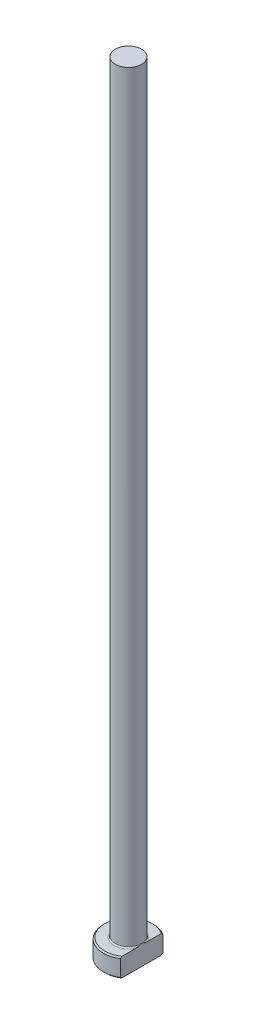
ISO-10303-21;
HEADER;
FILE_DESCRIPTION(('STEP AP214'),'2;1');
FILE_NAME('part.step','',(''),(''),'','','');
FILE_SCHEMA(('AUTOMOTIVE_DESIGN { 1 0 10303 214 1 1 1 1 }'));
ENDSEC;
DATA;
#1=APPLICATION_CONTEXT('core data for automotive mechanical design processes');
#2=APPLICATION_PROTOCOL_DEFINITION('international standard','automotive_design',2000,#1);
#3=PRODUCT_CONTEXT('',#1,'mechanical');
#4=PRODUCT('Part','Part','',(#3));
#5=PRODUCT_RELATED_PRODUCT_CATEGORY('part','',(#4));
#6=PRODUCT_DEFINITION_FORMATION('','',#4);
#7=PRODUCT_DEFINITION_CONTEXT('part definition',#1,'design');
#8=PRODUCT_DEFINITION('design','',#6,#7);
#9=PRODUCT_DEFINITION_SHAPE('','',#8);
#10=(LENGTH_UNIT() NAMED_UNIT(*) SI_UNIT(.MILLI.,.METRE.));
#11=(NAMED_UNIT(*) PLANE_ANGLE_UNIT() SI_UNIT($,.RADIAN.));
#12=(NAMED_UNIT(*) SI_UNIT($,.STERADIAN.) SOLID_ANGLE_UNIT());
#13=UNCERTAINTY_MEASURE_WITH_UNIT(LENGTH_MEASURE(1.E-05),#10,'distance_accuracy_value','');
#14=(GEOMETRIC_REPRESENTATION_CONTEXT(3) GLOBAL_UNCERTAINTY_ASSIGNED_CONTEXT((#13)) GLOBAL_UNIT_ASSIGNED_CONTEXT((#10,
#11,#12)) REPRESENTATION_CONTEXT('',''));
#15=CARTESIAN_POINT('',(0.,0.,0.));
#16=DIRECTION('',(0.,0.,1.));
#17=DIRECTION('',(1.,0.,0.));
#18=AXIS2_PLACEMENT_3D('',#15,#16,#17);
#19=CARTESIAN_POINT('',(0.,0.,0.));
#20=DIRECTION('',(0.,-1.,0.));
#21=DIRECTION('',(0.,0.,-1.));
#22=AXIS2_PLACEMENT_3D('',#19,#20,#21);
#23=PLANE('',#22);
#24=CARTESIAN_POINT('',(0.,0.,0.));
#25=DIRECTION('',(0.,-1.,0.));
#26=DIRECTION('',(0.,0.,-1.));
#27=AXIS2_PLACEMENT_3D('',#24,#25,#26);
#28=CIRCLE('',#27,3.79999999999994);
#29=CARTESIAN_POINT('',(2.09999999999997,0.,3.16701752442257));
#30=VERTEX_POINT('',#29);
#31=CARTESIAN_POINT('',(2.09999999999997,0.,-3.16701752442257));
#32=VERTEX_POINT('',#31);
#33=EDGE_CURVE('E98',#30,#32,#28,.T.);
#34=ORIENTED_EDGE('',*,*,#33,.T.);
#35=DIRECTION('',(0.,0.,1.));
#36=VECTOR('',#35,1.);
#37=CARTESIAN_POINT('',(2.09999999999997,0.,-3.40440890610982));
#38=LINE('',#37,#36);
#39=EDGE_CURVE('E83',#32,#30,#38,.T.);
#40=ORIENTED_EDGE('',*,*,#39,.T.);
#41=EDGE_LOOP('',(#34,#40));
#42=FACE_BOUND('',#41,.T.);
#43=ADVANCED_FACE('F32',(#42),#23,.T.);
#44=CARTESIAN_POINT('',(0.,259.958771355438,0.));
#45=DIRECTION('',(0.,1.,0.));
#46=DIRECTION('',(0.,0.,1.));
#47=AXIS2_PLACEMENT_3D('',#44,#45,#46);
#48=CYLINDRICAL_SURFACE('',#47,3.99999999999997);
#49=CARTESIAN_POINT('',(0.,2.79999999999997,0.));
#50=DIRECTION('',(0.,1.,0.));
#51=DIRECTION('',(0.,0.,1.));
#52=AXIS2_PLACEMENT_3D('',#49,#50,#51);
#53=CIRCLE('',#52,3.99999999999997);
#54=CARTESIAN_POINT('',(2.09999999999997,2.79999999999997,3.40440890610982));
#55=VERTEX_POINT('',#54);
#56=CARTESIAN_POINT('',(2.09999999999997,2.79999999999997,-3.40440890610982));
#57=VERTEX_POINT('',#56);
#58=EDGE_CURVE('E104',#55,#57,#53,.F.);
#59=ORIENTED_EDGE('',*,*,#58,.T.);
#60=DIRECTION('',(0.,-1.,0.));
#61=VECTOR('',#60,1.);
#62=CARTESIAN_POINT('',(2.09999999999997,125.,-3.40440890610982));
#63=LINE('',#62,#61);
#64=CARTESIAN_POINT('',(2.09999999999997,0.200000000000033,-3.40440890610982));
#65=VERTEX_POINT('',#64);
#66=EDGE_CURVE('E183',#57,#65,#63,.T.);
#67=ORIENTED_EDGE('',*,*,#66,.T.);
#68=CARTESIAN_POINT('',(0.,0.200000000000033,0.));
#69=DIRECTION('',(0.,-1.,0.));
#70=DIRECTION('',(0.,0.,-1.));
#71=AXIS2_PLACEMENT_3D('',#68,#69,#70);
#72=CIRCLE('',#71,3.99999999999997);
#73=CARTESIAN_POINT('',(2.09999999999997,0.200000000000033,3.40440890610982));
#74=VERTEX_POINT('',#73);
#75=EDGE_CURVE('E100',#65,#74,#72,.F.);
#76=ORIENTED_EDGE('',*,*,#75,.T.);
#77=DIRECTION('',(0.,-1.,0.));
#78=VECTOR('',#77,1.);
#79=CARTESIAN_POINT('',(2.09999999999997,125.,3.40440890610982));
#80=LINE('',#79,#78);
#81=EDGE_CURVE('E93',#55,#74,#80,.T.);
#82=ORIENTED_EDGE('',*,*,#81,.F.);
#83=EDGE_LOOP('',(#59,#67,#76,#82));
#84=FACE_BOUND('',#83,.T.);
#85=ADVANCED_FACE('F158',(#84),#48,.T.);
#86=CARTESIAN_POINT('',(-3.99999999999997,3.,0.));
#87=DIRECTION('',(0.,1.,0.));
#88=DIRECTION('',(0.,0.,1.));
#89=AXIS2_PLACEMENT_3D('',#86,#87,#88);
#90=PLANE('',#89);
#91=CARTESIAN_POINT('',(0.,3.,0.));
#92=DIRECTION('',(0.,1.,0.));
#93=DIRECTION('',(0.,0.,1.));
#94=AXIS2_PLACEMENT_3D('',#91,#92,#93);
#95=CIRCLE('',#94,3.79999999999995);
#96=CARTESIAN_POINT('',(2.09999999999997,3.,-3.16701752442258));
#97=VERTEX_POINT('',#96);
#98=CARTESIAN_POINT('',(2.09999999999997,3.,3.16701752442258));
#99=VERTEX_POINT('',#98);
#100=EDGE_CURVE('E178',#97,#99,#95,.T.);
#101=ORIENTED_EDGE('',*,*,#100,.T.);
#102=DIRECTION('',(0.,0.,-1.));
#103=VECTOR('',#102,1.);
#104=CARTESIAN_POINT('',(2.09999999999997,3.,0.));
#105=LINE('',#104,#103);
#106=CARTESIAN_POINT('',(2.09999999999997,2.99999999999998,0.938083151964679));
#107=VERTEX_POINT('',#106);
#108=EDGE_CURVE('E57',#99,#107,#105,.T.);
#109=ORIENTED_EDGE('',*,*,#108,.T.);
#110=CARTESIAN_POINT('',(0.,3.,0.));
#111=DIRECTION('',(0.,1.,0.));
#112=DIRECTION('',(0.,0.,1.));
#113=AXIS2_PLACEMENT_3D('',#110,#111,#112);
#114=CIRCLE('',#113,2.29999999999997);
#115=CARTESIAN_POINT('',(2.09999999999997,2.99999999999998,-0.938083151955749));
#116=VERTEX_POINT('',#115);
#117=EDGE_CURVE('E107',#107,#116,#114,.F.);
#118=ORIENTED_EDGE('',*,*,#117,.T.);
#119=EDGE_CURVE('E136',#116,#97,#105,.T.);
#120=ORIENTED_EDGE('',*,*,#119,.T.);
#121=EDGE_LOOP('',(#101,#109,#118,#120));
#122=FACE_BOUND('',#121,.T.);
#123=ADVANCED_FACE('F147',(#122),#90,.T.);
#124=CARTESIAN_POINT('',(0.,3.,0.));
#125=DIRECTION('',(0.,-1.,0.));
#126=DIRECTION('',(0.,0.,-1.));
#127=AXIS2_PLACEMENT_3D('',#124,#125,#126);
#128=CONICAL_SURFACE('',#127,3.79999999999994,0.785398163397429);
#129=ORIENTED_EDGE('',*,*,#58,.F.);
#130=CARTESIAN_POINT('',(2.09999999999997,-0.980423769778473,7.49166163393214));
#131=CARTESIAN_POINT('',(2.09999999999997,-0.831474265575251,7.33696373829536));
#132=CARTESIAN_POINT('',(2.09999999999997,-0.682692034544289,7.1821043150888));
#133=CARTESIAN_POINT('',(2.09999999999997,-0.385548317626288,6.87197961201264));
#134=CARTESIAN_POINT('',(2.09999999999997,-0.237186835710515,6.71671432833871));
#135=CARTESIAN_POINT('',(2.09999999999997,0.0590779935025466,6.40564381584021));
#136=CARTESIAN_POINT('',(2.09999999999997,0.206981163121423,6.24983841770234));
#137=CARTESIAN_POINT('',(2.09999999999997,0.502154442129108,5.9376299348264));
#138=CARTESIAN_POINT('',(2.09999999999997,0.649424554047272,5.78122685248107));
#139=CARTESIAN_POINT('',(2.09999999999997,0.940776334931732,5.47022973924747));
#140=CARTESIAN_POINT('',(2.09999999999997,1.08487085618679,5.31564775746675));
#141=CARTESIAN_POINT('',(2.09999999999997,1.372076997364,5.0055736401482));
#142=CARTESIAN_POINT('',(2.09999999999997,1.51518862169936,4.85008150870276));
#143=CARTESIAN_POINT('',(2.09999999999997,1.80010839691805,4.53794892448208));
#144=CARTESIAN_POINT('',(2.09999999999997,1.94191674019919,4.38130864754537));
#145=CARTESIAN_POINT('',(2.09999999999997,2.22381768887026,4.0664938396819));
#146=CARTESIAN_POINT('',(2.09999999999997,2.36391033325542,3.90831934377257));
#147=CARTESIAN_POINT('',(2.09999999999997,2.60581733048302,3.63104485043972));
#148=CARTESIAN_POINT('',(2.09999999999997,2.70816653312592,3.51241214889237));
#149=CARTESIAN_POINT('',(2.09999999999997,2.91116695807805,3.27367935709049));
#150=CARTESIAN_POINT('',(2.09999999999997,3.01181801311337,3.15357912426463));
#151=CARTESIAN_POINT('',(2.09999999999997,3.21179811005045,2.91033378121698));
#152=CARTESIAN_POINT('',(2.09999999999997,3.3111051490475,2.7871705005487));
#153=CARTESIAN_POINT('',(2.09999999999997,3.50648239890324,2.53834531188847));
#154=CARTESIAN_POINT('',(2.09999999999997,3.60255343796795,2.41268405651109));
#155=CARTESIAN_POINT('',(2.09999999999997,3.79142541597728,2.15619995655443));
#156=CARTESIAN_POINT('',(2.09999999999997,3.88416307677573,2.02532985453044));
#157=CARTESIAN_POINT('',(2.09999999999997,4.01801013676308,1.82534891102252));
#158=CARTESIAN_POINT('',(2.09999999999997,4.06178099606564,1.75802258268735));
#159=CARTESIAN_POINT('',(2.09999999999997,4.14708263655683,1.6219702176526));
#160=CARTESIAN_POINT('',(2.09999999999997,4.18861364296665,1.55324432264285));
#161=CARTESIAN_POINT('',(2.09999999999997,4.2684305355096,1.41491925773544));
#162=CARTESIAN_POINT('',(2.09999999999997,4.30674712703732,1.34533804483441));
#163=CARTESIAN_POINT('',(2.09999999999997,4.37989810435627,1.20437862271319));
#164=CARTESIAN_POINT('',(2.09999999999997,4.41473181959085,1.13300007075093));
#165=CARTESIAN_POINT('',(2.09999999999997,4.51246602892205,0.916193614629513));
#166=CARTESIAN_POINT('',(2.09999999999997,4.56890635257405,0.767589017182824));
#167=CARTESIAN_POINT('',(2.09999999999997,4.63146309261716,0.545044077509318));
#168=CARTESIAN_POINT('',(2.09999999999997,4.6482991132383,0.474096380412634));
#169=CARTESIAN_POINT('',(2.09999999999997,4.67524959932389,0.330910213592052));
#170=CARTESIAN_POINT('',(2.09999999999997,4.68536485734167,0.258671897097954));
#171=CARTESIAN_POINT('',(2.09999999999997,4.69814808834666,0.113837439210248));
#172=CARTESIAN_POINT('',(2.09999999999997,4.70084750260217,0.0412441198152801));
#173=CARTESIAN_POINT('',(2.09999999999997,4.69868618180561,-0.103832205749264));
#174=CARTESIAN_POINT('',(2.09999999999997,4.69382503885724,-0.176315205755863));
#175=CARTESIAN_POINT('',(2.09999999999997,4.67696192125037,-0.319913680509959));
#176=CARTESIAN_POINT('',(2.09999999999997,4.66501009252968,-0.391035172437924));
#177=CARTESIAN_POINT('',(2.09999999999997,4.63477414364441,-0.531925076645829));
#178=CARTESIAN_POINT('',(2.09999999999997,4.61648741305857,-0.601692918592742));
#179=CARTESIAN_POINT('',(2.09999999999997,4.57440952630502,-0.740018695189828));
#180=CARTESIAN_POINT('',(2.09999999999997,4.55058348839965,-0.808565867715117));
#181=CARTESIAN_POINT('',(2.09999999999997,4.49846635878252,-0.943903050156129));
#182=CARTESIAN_POINT('',(2.09999999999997,4.47017609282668,-1.01069338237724));
#183=CARTESIAN_POINT('',(2.09999999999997,4.38350646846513,-1.20069593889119));
#184=CARTESIAN_POINT('',(2.09999999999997,4.32056256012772,-1.3218187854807));
#185=CARTESIAN_POINT('',(2.09999999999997,4.18621189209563,-1.55931752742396));
#186=CARTESIAN_POINT('',(2.09999999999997,4.11479535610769,-1.67568772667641));
#187=CARTESIAN_POINT('',(2.09999999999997,3.96595132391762,-1.90511626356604));
#188=CARTESIAN_POINT('',(2.09999999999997,3.88850194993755,-2.0181602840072));
#189=CARTESIAN_POINT('',(2.09999999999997,3.7296086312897,-2.24129989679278));
#190=CARTESIAN_POINT('',(2.09999999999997,3.64816653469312,-2.3513968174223));
#191=CARTESIAN_POINT('',(2.09999999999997,3.4813341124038,-2.57073305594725));
#192=CARTESIAN_POINT('',(2.09999999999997,3.39590709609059,-2.67994433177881));
#193=CARTESIAN_POINT('',(2.09999999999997,3.22283750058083,-2.89660720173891));
#194=CARTESIAN_POINT('',(2.09999999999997,3.1351947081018,-3.0040586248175));
#195=CARTESIAN_POINT('',(2.09999999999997,2.95843815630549,-3.2173196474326));
#196=CARTESIAN_POINT('',(2.09999999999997,2.86932829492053,-3.32313248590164));
#197=CARTESIAN_POINT('',(2.09999999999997,2.68980874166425,-3.53365081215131));
#198=CARTESIAN_POINT('',(2.09999999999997,2.59939902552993,-3.63835627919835));
#199=CARTESIAN_POINT('',(2.09999999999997,2.36547490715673,-3.90659393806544));
#200=CARTESIAN_POINT('',(2.09999999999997,2.22120602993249,-4.06946765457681));
#201=CARTESIAN_POINT('',(2.09999999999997,1.93085962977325,-4.39359699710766));
#202=CARTESIAN_POINT('',(2.09999999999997,1.78478206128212,-4.55485258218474));
#203=CARTESIAN_POINT('',(2.09999999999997,1.49115582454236,-4.87627982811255));
#204=CARTESIAN_POINT('',(2.09999999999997,1.3436059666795,-5.03645040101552));
#205=CARTESIAN_POINT('',(2.09999999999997,1.04748117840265,-5.3558413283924));
#206=CARTESIAN_POINT('',(2.09999999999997,0.898906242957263,-5.51506167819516));
#207=CARTESIAN_POINT('',(2.09999999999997,0.463656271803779,-5.97917774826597));
#208=CARTESIAN_POINT('',(2.09999999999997,0.175917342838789,-6.28307552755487));
#209=CARTESIAN_POINT('',(2.09999999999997,-0.25695367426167,-6.73740739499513));
#210=CARTESIAN_POINT('',(2.09999999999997,-0.401377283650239,-6.88851889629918));
#211=CARTESIAN_POINT('',(2.09999999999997,-0.690621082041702,-7.1903594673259));
#212=CARTESIAN_POINT('',(2.09999999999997,-0.835441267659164,-7.34108854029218));
#213=CARTESIAN_POINT('',(2.09999999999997,-0.980423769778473,-7.49166163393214));
#214=B_SPLINE_CURVE_WITH_KNOTS('',3,(#130,#131,#132,#133,#134,#135,#136,#137,#138,#139,#140,
#141,#142,#143,#144,#145,#146,#147,#148,#149,#150,#151,#152,#153,#154,#155,#156,#157,#158,#159,
#160,#161,#162,#163,#164,#165,#166,#167,#168,#169,#170,#171,#172,#173,#174,#175,#176,#177,#178,
#179,#180,#181,#182,#183,#184,#185,#186,#187,#188,#189,#190,#191,#192,#193,#194,#195,#196,#197,
#198,#199,#200,#201,#202,#203,#204,#205,#206,#207,#208,#209,#210,#211,#212,#213),.UNSPECIFIED.,
.F.,.F.,(4,2,2,2,2,2,2,2,2,2,2,2,2,2,2,2,2,2,2,2,2,2,2,2,2,2,2,2,2,2,2,2,2,2,2,2,2,2,2,2,2,4),
(0.,0.644249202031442,1.28850446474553,1.93298425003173,2.577461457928,3.21143723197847,
3.84541015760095,4.47928793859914,5.11315128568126,5.58318355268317,6.05326185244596,
6.52785804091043,7.00233182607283,7.48334172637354,7.72421875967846,7.96507152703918,
8.20327136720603,8.441516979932,8.91624038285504,9.13473354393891,9.35320093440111,
9.57074063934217,9.78829208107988,10.0043230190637,10.2204430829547,10.4379628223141,
10.6554423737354,11.0643686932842,11.4737715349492,11.8847351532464,12.2955103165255,
12.7114337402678,13.1273973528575,13.5423929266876,13.9573962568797,14.6101174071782,
15.2628550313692,15.9161714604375,16.5694910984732,17.8249945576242,18.452079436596,
19.0791589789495),.UNSPECIFIED.);
#215=EDGE_CURVE('E135',#55,#99,#214,.T.);
#216=ORIENTED_EDGE('',*,*,#215,.T.);
#217=ORIENTED_EDGE('',*,*,#100,.F.);
#218=EDGE_CURVE('E127',#97,#57,#214,.T.);
#219=ORIENTED_EDGE('',*,*,#218,.T.);
#220=EDGE_LOOP('',(#129,#216,#217,#219));
#221=FACE_BOUND('',#220,.T.);
#222=ADVANCED_FACE('F143',(#221),#128,.T.);
#223=CARTESIAN_POINT('',(0.,0.200000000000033,0.));
#224=DIRECTION('',(0.,1.,0.));
#225=DIRECTION('',(0.,0.,1.));
#226=AXIS2_PLACEMENT_3D('',#223,#224,#225);
#227=CONICAL_SURFACE('',#226,3.99999999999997,0.785398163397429);
#228=ORIENTED_EDGE('',*,*,#75,.F.);
#229=CARTESIAN_POINT('',(2.09999999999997,3.98042376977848,-7.49166163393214));
#230=CARTESIAN_POINT('',(2.09999999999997,3.83147426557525,-7.33696373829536));
#231=CARTESIAN_POINT('',(2.09999999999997,3.68269203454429,-7.1821043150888));
#232=CARTESIAN_POINT('',(2.09999999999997,3.38554831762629,-6.87197961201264));
#233=CARTESIAN_POINT('',(2.09999999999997,3.23718683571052,-6.71671432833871));
#234=CARTESIAN_POINT('',(2.09999999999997,2.94092200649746,-6.40564381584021));
#235=CARTESIAN_POINT('',(2.09999999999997,2.79301883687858,-6.24983841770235));
#236=CARTESIAN_POINT('',(2.09999999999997,2.4978455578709,-5.9376299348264));
#237=CARTESIAN_POINT('',(2.09999999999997,2.35057544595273,-5.78122685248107));
#238=CARTESIAN_POINT('',(2.09999999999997,2.05922366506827,-5.47022973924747));
#239=CARTESIAN_POINT('',(2.09999999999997,1.91512914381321,-5.31564775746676));
#240=CARTESIAN_POINT('',(2.09999999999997,1.62792300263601,-5.0055736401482));
#241=CARTESIAN_POINT('',(2.09999999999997,1.48481137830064,-4.85008150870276));
#242=CARTESIAN_POINT('',(2.09999999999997,1.19989160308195,-4.53794892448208));
#243=CARTESIAN_POINT('',(2.09999999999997,1.05808325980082,-4.38130864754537));
#244=CARTESIAN_POINT('',(2.09999999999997,0.776182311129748,-4.0664938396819));
#245=CARTESIAN_POINT('',(2.09999999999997,0.63608966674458,-3.90831934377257));
#246=CARTESIAN_POINT('',(2.09999999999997,0.394182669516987,-3.63104485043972));
#247=CARTESIAN_POINT('',(2.09999999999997,0.291833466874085,-3.51241214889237));
#248=CARTESIAN_POINT('',(2.09999999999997,0.0888330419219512,-3.27367935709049));
#249=CARTESIAN_POINT('',(2.09999999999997,-0.0118180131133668,-3.15357912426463));
#250=CARTESIAN_POINT('',(2.09999999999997,-0.211798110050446,-2.91033378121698));
#251=CARTESIAN_POINT('',(2.09999999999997,-0.311105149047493,-2.7871705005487));
#252=CARTESIAN_POINT('',(2.09999999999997,-0.506482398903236,-2.53834531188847));
#253=CARTESIAN_POINT('',(2.09999999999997,-0.602553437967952,-2.41268405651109));
#254=CARTESIAN_POINT('',(2.09999999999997,-0.791425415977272,-2.15619995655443));
#255=CARTESIAN_POINT('',(2.09999999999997,-0.884163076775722,-2.02532985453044));
#256=CARTESIAN_POINT('',(2.09999999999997,-1.01801013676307,-1.82534891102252));
#257=CARTESIAN_POINT('',(2.09999999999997,-1.06178099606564,-1.75802258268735));
#258=CARTESIAN_POINT('',(2.09999999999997,-1.14708263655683,-1.6219702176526));
#259=CARTESIAN_POINT('',(2.09999999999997,-1.18861364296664,-1.55324432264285));
#260=CARTESIAN_POINT('',(2.09999999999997,-1.26843053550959,-1.41491925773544));
#261=CARTESIAN_POINT('',(2.09999999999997,-1.30674712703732,-1.34533804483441));
#262=CARTESIAN_POINT('',(2.09999999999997,-1.37989810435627,-1.20437862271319));
#263=CARTESIAN_POINT('',(2.09999999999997,-1.41473181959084,-1.13300007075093));
#264=CARTESIAN_POINT('',(2.09999999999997,-1.51246602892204,-0.916193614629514));
#265=CARTESIAN_POINT('',(2.09999999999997,-1.56890635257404,-0.767589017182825));
#266=CARTESIAN_POINT('',(2.09999999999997,-1.63146309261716,-0.545044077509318));
#267=CARTESIAN_POINT('',(2.09999999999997,-1.64829911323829,-0.474096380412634));
#268=CARTESIAN_POINT('',(2.09999999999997,-1.67524959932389,-0.330910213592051));
#269=CARTESIAN_POINT('',(2.09999999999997,-1.68536485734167,-0.258671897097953));
#270=CARTESIAN_POINT('',(2.09999999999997,-1.69814808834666,-0.113837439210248));
#271=CARTESIAN_POINT('',(2.09999999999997,-1.70084750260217,-0.04124411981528));
#272=CARTESIAN_POINT('',(2.09999999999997,-1.69868618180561,0.103832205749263));
#273=CARTESIAN_POINT('',(2.09999999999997,-1.69382503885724,0.176315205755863));
#274=CARTESIAN_POINT('',(2.09999999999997,-1.67696192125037,0.319913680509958));
#275=CARTESIAN_POINT('',(2.09999999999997,-1.66501009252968,0.391035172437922));
#276=CARTESIAN_POINT('',(2.09999999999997,-1.63477414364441,0.531925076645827));
#277=CARTESIAN_POINT('',(2.09999999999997,-1.61648741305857,0.601692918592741));
#278=CARTESIAN_POINT('',(2.09999999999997,-1.57440952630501,0.740018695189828));
#279=CARTESIAN_POINT('',(2.09999999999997,-1.55058348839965,0.808565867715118));
#280=CARTESIAN_POINT('',(2.09999999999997,-1.49846635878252,0.94390305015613));
#281=CARTESIAN_POINT('',(2.09999999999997,-1.47017609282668,1.01069338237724));
#282=CARTESIAN_POINT('',(2.09999999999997,-1.38350646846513,1.2006959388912));
#283=CARTESIAN_POINT('',(2.09999999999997,-1.32056256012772,1.3218187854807));
#284=CARTESIAN_POINT('',(2.09999999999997,-1.18621189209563,1.55931752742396));
#285=CARTESIAN_POINT('',(2.09999999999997,-1.11479535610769,1.67568772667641));
#286=CARTESIAN_POINT('',(2.09999999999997,-0.965951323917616,1.90511626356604));
#287=CARTESIAN_POINT('',(2.09999999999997,-0.888501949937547,2.01816028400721));
#288=CARTESIAN_POINT('',(2.09999999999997,-0.729608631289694,2.24129989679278));
#289=CARTESIAN_POINT('',(2.09999999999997,-0.64816653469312,2.3513968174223));
#290=CARTESIAN_POINT('',(2.09999999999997,-0.481334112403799,2.57073305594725));
#291=CARTESIAN_POINT('',(2.09999999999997,-0.395907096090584,2.67994433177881));
#292=CARTESIAN_POINT('',(2.09999999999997,-0.222837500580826,2.89660720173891));
#293=CARTESIAN_POINT('',(2.09999999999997,-0.135194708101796,3.0040586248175));
#294=CARTESIAN_POINT('',(2.09999999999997,0.0415618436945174,3.2173196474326));
#295=CARTESIAN_POINT('',(2.09999999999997,0.130671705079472,3.32313248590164));
#296=CARTESIAN_POINT('',(2.09999999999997,0.310191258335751,3.53365081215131));
#297=CARTESIAN_POINT('',(2.09999999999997,0.400600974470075,3.63835627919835));
#298=CARTESIAN_POINT('',(2.09999999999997,0.634525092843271,3.90659393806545));
#299=CARTESIAN_POINT('',(2.09999999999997,0.778793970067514,4.06946765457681));
#300=CARTESIAN_POINT('',(2.09999999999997,1.06914037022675,4.39359699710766));
#301=CARTESIAN_POINT('',(2.09999999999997,1.21521793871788,4.55485258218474));
#302=CARTESIAN_POINT('',(2.09999999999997,1.50884417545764,4.87627982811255));
#303=CARTESIAN_POINT('',(2.09999999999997,1.6563940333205,5.03645040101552));
#304=CARTESIAN_POINT('',(2.09999999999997,1.95251882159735,5.3558413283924));
#305=CARTESIAN_POINT('',(2.09999999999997,2.10109375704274,5.51506167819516));
#306=CARTESIAN_POINT('',(2.09999999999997,2.53634372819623,5.97917774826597));
#307=CARTESIAN_POINT('',(2.09999999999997,2.82408265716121,6.28307552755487));
#308=CARTESIAN_POINT('',(2.09999999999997,3.25695367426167,6.73740739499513));
#309=CARTESIAN_POINT('',(2.09999999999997,3.40137728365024,6.88851889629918));
#310=CARTESIAN_POINT('',(2.09999999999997,3.6906210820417,7.1903594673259));
#311=CARTESIAN_POINT('',(2.09999999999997,3.83544126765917,7.34108854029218));
#312=CARTESIAN_POINT('',(2.09999999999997,3.98042376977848,7.49166163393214));
#313=B_SPLINE_CURVE_WITH_KNOTS('',3,(#229,#230,#231,#232,#233,#234,#235,#236,#237,#238,#239,
#240,#241,#242,#243,#244,#245,#246,#247,#248,#249,#250,#251,#252,#253,#254,#255,#256,#257,#258,
#259,#260,#261,#262,#263,#264,#265,#266,#267,#268,#269,#270,#271,#272,#273,#274,#275,#276,#277,
#278,#279,#280,#281,#282,#283,#284,#285,#286,#287,#288,#289,#290,#291,#292,#293,#294,#295,#296,
#297,#298,#299,#300,#301,#302,#303,#304,#305,#306,#307,#308,#309,#310,#311,#312),.UNSPECIFIED.,
.F.,.F.,(4,2,2,2,2,2,2,2,2,2,2,2,2,2,2,2,2,2,2,2,2,2,2,2,2,2,2,2,2,2,2,2,2,2,2,2,2,2,2,2,2,4),
(0.,0.64424920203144,1.28850446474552,1.93298425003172,2.577461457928,3.21143723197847,
3.84541015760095,4.47928793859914,5.11315128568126,5.58318355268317,6.05326185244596,
6.52785804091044,7.00233182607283,7.48334172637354,7.72421875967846,7.96507152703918,
8.20327136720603,8.441516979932,8.91624038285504,9.13473354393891,9.35320093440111,
9.57074063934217,9.78829208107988,10.0043230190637,10.2204430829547,10.4379628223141,
10.6554423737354,11.0643686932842,11.4737715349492,11.8847351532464,12.2955103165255,
12.7114337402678,13.1273973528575,13.5423929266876,13.9573962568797,14.6101174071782,
15.2628550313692,15.9161714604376,16.5694910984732,17.8249945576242,18.452079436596,
19.0791589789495),.UNSPECIFIED.);
#314=EDGE_CURVE('E86',#65,#32,#313,.T.);
#315=ORIENTED_EDGE('',*,*,#314,.T.);
#316=ORIENTED_EDGE('',*,*,#33,.F.);
#317=EDGE_CURVE('E89',#30,#74,#313,.T.);
#318=ORIENTED_EDGE('',*,*,#317,.T.);
#319=EDGE_LOOP('',(#228,#315,#316,#318));
#320=FACE_BOUND('',#319,.T.);
#321=ADVANCED_FACE('F97',(#320),#227,.T.);
#322=CARTESIAN_POINT('',(0.,3.19999999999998,0.));
#323=DIRECTION('',(0.,1.,0.));
#324=DIRECTION('',(0.,0.,1.));
#325=AXIS2_PLACEMENT_3D('',#322,#323,#324);
#326=TOROIDAL_SURFACE('',#325,2.29999999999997,0.2);
#327=CARTESIAN_POINT('',(2.09999999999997,3.19999999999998,0.));
#328=CARTESIAN_POINT('',(2.09999999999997,3.20000050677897,1.12871213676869E-10));
#329=CARTESIAN_POINT('',(2.09999999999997,3.20000101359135,-1.5160230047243E-07));
#330=CARTESIAN_POINT('',(2.09999999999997,3.20000197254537,-5.98005719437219E-07));
#331=CARTESIAN_POINT('',(2.09999999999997,3.2000024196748,-9.0062574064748E-07));
#332=CARTESIAN_POINT('',(2.09999999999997,3.20000332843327,-1.62318945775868E-06));
#333=CARTESIAN_POINT('',(2.09999999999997,3.20000378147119,-2.05406588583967E-06));
#334=CARTESIAN_POINT('',(2.09999999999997,3.20000461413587,-2.96308561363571E-06));
#335=CARTESIAN_POINT('',(2.09999999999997,3.20000499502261,-3.4401425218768E-06));
#336=CARTESIAN_POINT('',(2.09999999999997,3.20000634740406,-5.22586037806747E-06));
#337=CARTESIAN_POINT('',(2.09999999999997,3.20000724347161,-6.59340897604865E-06));
#338=CARTESIAN_POINT('',(2.09999999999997,3.20000877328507,-9.35203600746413E-06));
#339=CARTESIAN_POINT('',(2.09999999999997,3.20000941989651,-1.07363396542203E-05));
#340=CARTESIAN_POINT('',(2.09999999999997,3.20001201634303,-1.6407290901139E-05));
#341=CARTESIAN_POINT('',(2.09999999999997,3.20001387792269,-2.07387533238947E-05));
#342=CARTESIAN_POINT('',(2.09999999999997,3.2000167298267,-2.90585196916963E-05));
#343=CARTESIAN_POINT('',(2.09999999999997,3.20001780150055,-3.30191375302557E-05));
#344=CARTESIAN_POINT('',(2.09999999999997,3.20002541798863,-6.18759983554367E-05));
#345=CARTESIAN_POINT('',(2.09999999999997,3.20003100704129,-8.69774695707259E-05));
#346=CARTESIAN_POINT('',(2.09999999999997,3.20005545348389,-0.000185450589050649));
#347=CARTESIAN_POINT('',(2.09999999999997,3.20007895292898,-0.000257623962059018));
#348=CARTESIAN_POINT('',(2.09999999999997,3.20016974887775,-0.000541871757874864));
#349=CARTESIAN_POINT('',(2.09999999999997,3.20023388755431,-0.000754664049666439));
#350=CARTESIAN_POINT('',(2.09999999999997,3.20048929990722,-0.00159500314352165));
#351=CARTESIAN_POINT('',(2.09999999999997,3.2006844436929,-0.00222165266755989));
#352=CARTESIAN_POINT('',(2.09999999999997,3.2014903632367,-0.00481735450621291));
#353=CARTESIAN_POINT('',(2.09999999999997,3.2020963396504,-0.0067875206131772));
#354=CARTESIAN_POINT('',(2.09999999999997,3.20811857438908,-0.0263575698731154));
#355=CARTESIAN_POINT('',(2.09999999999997,3.21355673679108,-0.0439525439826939));
#356=CARTESIAN_POINT('',(2.09999999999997,3.22417769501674,-0.078471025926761));
#357=CARTESIAN_POINT('',(2.09999999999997,3.22936219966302,-0.0953940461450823));
#358=CARTESIAN_POINT('',(2.09999999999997,3.24031741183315,-0.131344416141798));
#359=CARTESIAN_POINT('',(2.09999999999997,3.24608153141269,-0.150373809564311));
#360=CARTESIAN_POINT('',(2.09999999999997,3.25756719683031,-0.188666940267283));
#361=CARTESIAN_POINT('',(2.09999999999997,3.263287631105,-0.207931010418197));
#362=CARTESIAN_POINT('',(2.09999999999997,3.27708776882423,-0.255037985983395));
#363=CARTESIAN_POINT('',(2.09999999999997,3.2850908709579,-0.282903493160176));
#364=CARTESIAN_POINT('',(2.09999999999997,3.30049018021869,-0.33805925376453));
#365=CARTESIAN_POINT('',(2.09999999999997,3.30789650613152,-0.365346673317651));
#366=CARTESIAN_POINT('',(2.09999999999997,3.32422959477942,-0.427831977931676));
#367=CARTESIAN_POINT('',(2.09999999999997,3.33299018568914,-0.46307381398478));
#368=CARTESIAN_POINT('',(2.09999999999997,3.34944378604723,-0.534083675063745));
#369=CARTESIAN_POINT('',(2.09999999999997,3.35712842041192,-0.569853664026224));
#370=CARTESIAN_POINT('',(2.09999999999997,3.37150595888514,-0.644262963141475));
#371=CARTESIAN_POINT('',(2.09999999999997,3.37808822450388,-0.682924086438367));
#372=CARTESIAN_POINT('',(2.09999999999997,3.38900927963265,-0.760558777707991));
#373=CARTESIAN_POINT('',(2.09999999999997,3.39334901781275,-0.799532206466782));
#374=CARTESIAN_POINT('',(2.09999999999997,3.39885385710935,-0.874699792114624));
#375=CARTESIAN_POINT('',(2.09999999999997,3.40023755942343,-0.910877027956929));
#376=CARTESIAN_POINT('',(2.09999999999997,3.39969515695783,-0.983205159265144));
#377=CARTESIAN_POINT('',(2.09999999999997,3.39777304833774,-1.01935603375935));
#378=CARTESIAN_POINT('',(2.09999999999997,3.39020522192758,-1.08431292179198));
#379=CARTESIAN_POINT('',(2.09999999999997,3.38533825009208,-1.11320671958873));
#380=CARTESIAN_POINT('',(2.09999999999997,3.37160685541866,-1.1700898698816));
#381=CARTESIAN_POINT('',(2.09999999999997,3.36275087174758,-1.19808099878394));
#382=CARTESIAN_POINT('',(2.09999999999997,3.34648318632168,-1.23525714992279));
#383=CARTESIAN_POINT('',(2.09999999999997,3.34148711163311,-1.24549622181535));
#384=CARTESIAN_POINT('',(2.09999999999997,3.33045865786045,-1.26542566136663));
#385=CARTESIAN_POINT('',(2.09999999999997,3.32442526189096,-1.27511547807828));
#386=CARTESIAN_POINT('',(2.09999999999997,3.31108244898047,-1.29375285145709));
#387=CARTESIAN_POINT('',(2.09999999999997,3.30375956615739,-1.30269093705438));
#388=CARTESIAN_POINT('',(2.09999999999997,3.28770931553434,-1.31920846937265));
#389=CARTESIAN_POINT('',(2.09999999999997,3.27898657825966,-1.32679222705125));
#390=CARTESIAN_POINT('',(2.09999999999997,3.26379332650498,-1.33730272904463));
#391=CARTESIAN_POINT('',(2.09999999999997,3.25778099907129,-1.34088947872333));
#392=CARTESIAN_POINT('',(2.09999999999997,3.24526530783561,-1.34707853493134));
#393=CARTESIAN_POINT('',(2.09999999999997,3.23876236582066,-1.34968167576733));
#394=CARTESIAN_POINT('',(2.09999999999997,3.22533138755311,-1.35371298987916));
#395=CARTESIAN_POINT('',(2.09999999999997,3.21840009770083,-1.35513055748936));
#396=CARTESIAN_POINT('',(2.09999999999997,3.2043942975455,-1.35660326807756));
#397=CARTESIAN_POINT('',(2.09999999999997,3.19731988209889,-1.35665928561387));
#398=CARTESIAN_POINT('',(2.09999999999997,3.18410044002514,-1.35547833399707));
#399=CARTESIAN_POINT('',(2.09999999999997,3.17794157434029,-1.3543883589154));
#400=CARTESIAN_POINT('',(2.09999999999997,3.16588195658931,-1.35123020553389));
#401=CARTESIAN_POINT('',(2.09999999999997,3.15998132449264,-1.34916157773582));
#402=CARTESIAN_POINT('',(2.09999999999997,3.14673410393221,-1.34339681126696));
#403=CARTESIAN_POINT('',(2.09999999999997,3.13952216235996,-1.33939261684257));
#404=CARTESIAN_POINT('',(2.09999999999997,3.1258371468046,-1.33027651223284));
#405=CARTESIAN_POINT('',(2.09999999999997,3.11936569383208,-1.3251622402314));
#406=CARTESIAN_POINT('',(2.09999999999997,3.10400061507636,-1.31126465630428));
#407=CARTESIAN_POINT('',(2.09999999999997,3.09558831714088,-1.3019528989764));
#408=CARTESIAN_POINT('',(2.09999999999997,3.0802757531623,-1.28218529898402));
#409=CARTESIAN_POINT('',(2.09999999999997,3.07337755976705,-1.27172791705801));
#410=CARTESIAN_POINT('',(2.09999999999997,3.05595453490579,-1.24164701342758));
#411=CARTESIAN_POINT('',(2.09999999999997,3.0467992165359,-1.22123760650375));
#412=CARTESIAN_POINT('',(2.09999999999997,3.03140603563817,-1.17923303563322));
#413=CARTESIAN_POINT('',(2.09999999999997,3.02519350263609,-1.15762930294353));
#414=CARTESIAN_POINT('',(2.09999999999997,3.014897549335,-1.11311363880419));
#415=CARTESIAN_POINT('',(2.09999999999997,3.01089884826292,-1.09018261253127));
#416=CARTESIAN_POINT('',(2.09999999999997,3.00485282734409,-1.04403569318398));
#417=CARTESIAN_POINT('',(2.09999999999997,3.00280937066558,-1.02081932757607));
#418=CARTESIAN_POINT('',(2.09999999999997,2.99913236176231,-0.952629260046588));
#419=CARTESIAN_POINT('',(2.09999999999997,2.99965574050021,-0.907543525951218));
#420=CARTESIAN_POINT('',(2.09999999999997,3.00580977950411,-0.79983290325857));
#421=CARTESIAN_POINT('',(2.09999999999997,3.01338406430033,-0.737345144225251));
#422=CARTESIAN_POINT('',(2.09999999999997,3.03389167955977,-0.611758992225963));
#423=CARTESIAN_POINT('',(2.09999999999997,3.04695134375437,-0.548682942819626));
#424=CARTESIAN_POINT('',(2.09999999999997,3.07174522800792,-0.44346393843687));
#425=CARTESIAN_POINT('',(2.09999999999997,3.08256100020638,-0.401095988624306));
#426=CARTESIAN_POINT('',(2.09999999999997,3.10517491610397,-0.317118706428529));
#427=CARTESIAN_POINT('',(2.09999999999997,3.11696109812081,-0.275506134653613));
#428=CARTESIAN_POINT('',(2.09999999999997,3.13984946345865,-0.197106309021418));
#429=CARTESIAN_POINT('',(2.09999999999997,3.15088145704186,-0.160298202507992));
#430=CARTESIAN_POINT('',(2.09999999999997,3.17371469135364,-0.0852465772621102));
#431=CARTESIAN_POINT('',(2.09999999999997,3.18552885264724,-0.0470069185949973));
#432=CARTESIAN_POINT('',(2.09999999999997,3.1979046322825,-0.00678406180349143));
#433=CARTESIAN_POINT('',(2.09999999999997,3.19851173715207,-0.0048104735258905));
#434=CARTESIAN_POINT('',(2.09999999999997,3.19931792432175,-0.00221397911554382));
#435=CARTESIAN_POINT('',(2.09999999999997,3.19951224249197,-0.00158996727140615));
#436=CARTESIAN_POINT('',(2.09999999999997,3.19976664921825,-0.000752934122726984));
#437=CARTESIAN_POINT('',(2.09999999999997,3.1998305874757,-0.000540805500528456));
#438=CARTESIAN_POINT('',(2.09999999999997,3.19992113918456,-0.00025733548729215));
#439=CARTESIAN_POINT('',(2.09999999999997,3.19994460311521,-0.000185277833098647));
#440=CARTESIAN_POINT('',(2.09999999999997,3.19996901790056,-8.69395480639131E-05));
#441=CARTESIAN_POINT('',(2.09999999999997,3.1999746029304,-6.18551879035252E-05));
#442=CARTESIAN_POINT('',(2.09999999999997,3.19998221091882,-3.30155874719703E-05));
#443=CARTESIAN_POINT('',(2.09999999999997,3.19998328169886,-2.90560037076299E-05));
#444=CARTESIAN_POINT('',(2.09999999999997,3.19998613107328,-2.07382812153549E-05));
#445=CARTESIAN_POINT('',(2.09999999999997,3.19998799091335,-1.64077754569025E-05));
#446=CARTESIAN_POINT('',(2.09999999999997,3.19999058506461,-1.0737787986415E-05));
#447=CARTESIAN_POINT('',(2.09999999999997,3.19999123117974,-9.35356155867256E-06));
#448=CARTESIAN_POINT('',(2.09999999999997,3.19999275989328,-6.59500016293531E-06));
#449=CARTESIAN_POINT('',(2.09999999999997,3.19999365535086,-5.22743189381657E-06));
#450=CARTESIAN_POINT('',(2.09999999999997,3.19999500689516,-3.44158185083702E-06));
#451=CARTESIAN_POINT('',(2.09999999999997,3.19999538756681,-2.96446374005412E-06));
#452=CARTESIAN_POINT('',(2.09999999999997,3.19999621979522,-2.05528284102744E-06));
#453=CARTESIAN_POINT('',(2.09999999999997,3.1999966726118,-1.62430552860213E-06));
#454=CARTESIAN_POINT('',(2.09999999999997,3.19999758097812,-9.01501322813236E-07));
#455=CARTESIAN_POINT('',(2.09999999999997,3.19999802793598,-5.98749119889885E-07));
#456=CARTESIAN_POINT('',(2.09999999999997,3.19999898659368,-1.52018312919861E-07));
#457=CARTESIAN_POINT('',(2.09999999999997,3.19999949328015,-1.12858037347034E-10));
#458=CARTESIAN_POINT('',(2.09999999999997,3.19999999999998,0.));
#459=B_SPLINE_CURVE_WITH_KNOTS('',3,(#327,#328,#329,#330,#331,#332,#333,#334,#335,#336,#337,
#338,#339,#340,#341,#342,#343,#344,#345,#346,#347,#348,#349,#350,#351,#352,#353,#354,#355,#356,
#357,#358,#359,#360,#361,#362,#363,#364,#365,#366,#367,#368,#369,#370,#371,#372,#373,#374,#375,
#376,#377,#378,#379,#380,#381,#382,#383,#384,#385,#386,#387,#388,#389,#390,#391,#392,#393,#394,
#395,#396,#397,#398,#399,#400,#401,#402,#403,#404,#405,#406,#407,#408,#409,#410,#411,#412,#413,
#414,#415,#416,#417,#418,#419,#420,#421,#422,#423,#424,#425,#426,#427,#428,#429,#430,#431,#432,
#433,#434,#435,#436,#437,#438,#439,#440,#441,#442,#443,#444,#445,#446,#447,#448,#449,#450,#451,
#452,#453,#454,#455,#456,#457,#458),.UNSPECIFIED.,.T.,.F.,(4,2,2,2,2,2,2,2,2,2,2,2,2,2,2,2,2,2,
2,2,2,2,2,2,2,2,2,2,2,2,2,2,2,2,2,2,2,2,2,2,2,2,2,2,2,2,2,2,2,2,2,2,2,2,2,2,2,2,2,2,2,2,2,2,2,
4),(0.,1.52446483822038E-06,3.13917159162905E-06,5.00540711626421E-06,6.83522638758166E-06,
1.1719467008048E-05,1.62993936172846E-05,3.04103902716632E-05,4.27033722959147E-05,
0.000119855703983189,0.000347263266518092,0.00101430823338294,0.002982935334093,
0.00916710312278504,0.0644134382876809,0.117512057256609,0.17716136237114,0.237447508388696,
0.324420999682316,0.409241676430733,0.518170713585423,0.627905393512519,0.745509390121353,
0.863063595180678,0.971571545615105,1.07994842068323,1.1676881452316,1.25524311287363,
1.28937713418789,1.32354480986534,1.35809310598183,1.39252939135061,1.41346149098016,
1.43437579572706,1.45547524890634,1.47656114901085,1.49523795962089,1.51392335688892,
1.53853256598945,1.56319465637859,1.60062921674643,1.63811470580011,1.7048463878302,
1.77214245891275,1.84186170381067,1.91171841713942,2.04668000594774,2.23517885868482,
2.42828019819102,2.55944432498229,2.68918212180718,2.80445903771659,2.9245225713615,
2.93071753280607,2.93267787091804,2.93334283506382,2.93356987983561,2.93364697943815,
2.93365926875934,2.93367337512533,2.93367795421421,2.93368283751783,2.93368466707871,
2.9336865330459,2.93368814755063,2.93368967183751),.UNSPECIFIED.);
#460=CARTESIAN_POINT('',(2.09999999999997,3.19999999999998,0.));
#461=VERTEX_POINT('',#460);
#462=EDGE_CURVE('E11',#116,#461,#459,.T.);
#463=ORIENTED_EDGE('',*,*,#462,.F.);
#464=ORIENTED_EDGE('',*,*,#117,.F.);
#465=CARTESIAN_POINT('',(2.09999999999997,3.19999999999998,0.));
#466=CARTESIAN_POINT('',(2.09999999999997,3.19999949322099,-1.12871210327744E-10));
#467=CARTESIAN_POINT('',(2.09999999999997,3.19999898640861,1.51602300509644E-07));
#468=CARTESIAN_POINT('',(2.09999999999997,3.19999802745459,5.98005719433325E-07));
#469=CARTESIAN_POINT('',(2.09999999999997,3.19999758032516,9.00625740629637E-07));
#470=CARTESIAN_POINT('',(2.09999999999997,3.19999667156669,1.62318945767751E-06));
#471=CARTESIAN_POINT('',(2.09999999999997,3.19999621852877,2.05406588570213E-06));
#472=CARTESIAN_POINT('',(2.09999999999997,3.1999953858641,2.96308561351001E-06));
#473=CARTESIAN_POINT('',(2.09999999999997,3.19999500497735,3.4401425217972E-06));
#474=CARTESIAN_POINT('',(2.09999999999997,3.1999936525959,5.22586037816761E-06));
#475=CARTESIAN_POINT('',(2.09999999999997,3.19999275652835,6.5934089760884E-06));
#476=CARTESIAN_POINT('',(2.09999999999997,3.19999122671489,9.3520360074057E-06));
#477=CARTESIAN_POINT('',(2.09999999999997,3.19999058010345,1.0736339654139E-05));
#478=CARTESIAN_POINT('',(2.09999999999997,3.19998798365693,1.64072909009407E-05));
#479=CARTESIAN_POINT('',(2.09999999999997,3.19998612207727,2.07387533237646E-05));
#480=CARTESIAN_POINT('',(2.09999999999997,3.19998327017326,2.90585196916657E-05));
#481=CARTESIAN_POINT('',(2.09999999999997,3.19998219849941,3.30191375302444E-05));
#482=CARTESIAN_POINT('',(2.09999999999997,3.19997458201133,6.18759983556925E-05));
#483=CARTESIAN_POINT('',(2.09999999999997,3.19996899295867,8.69774695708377E-05));
#484=CARTESIAN_POINT('',(2.09999999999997,3.19994454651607,0.000185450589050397));
#485=CARTESIAN_POINT('',(2.09999999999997,3.19992104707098,0.000257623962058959));
#486=CARTESIAN_POINT('',(2.09999999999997,3.19983025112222,0.000541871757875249));
#487=CARTESIAN_POINT('',(2.09999999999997,3.19976611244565,0.000754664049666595));
#488=CARTESIAN_POINT('',(2.09999999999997,3.19951070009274,0.00159500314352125));
#489=CARTESIAN_POINT('',(2.09999999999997,3.19931555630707,0.00222165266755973));
#490=CARTESIAN_POINT('',(2.09999999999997,3.19850963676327,0.00481735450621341));
#491=CARTESIAN_POINT('',(2.09999999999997,3.19790366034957,0.00678752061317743));
#492=CARTESIAN_POINT('',(2.09999999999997,3.19188142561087,0.0263575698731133));
#493=CARTESIAN_POINT('',(2.09999999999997,3.18644326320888,0.0439525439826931));
#494=CARTESIAN_POINT('',(2.09999999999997,3.17582230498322,0.0784710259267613));
#495=CARTESIAN_POINT('',(2.09999999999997,3.17063780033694,0.0953940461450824));
#496=CARTESIAN_POINT('',(2.09999999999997,3.15968258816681,0.131344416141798));
#497=CARTESIAN_POINT('',(2.09999999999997,3.15391846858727,0.150373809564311));
#498=CARTESIAN_POINT('',(2.09999999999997,3.14243280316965,0.188666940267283));
#499=CARTESIAN_POINT('',(2.09999999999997,3.13671236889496,0.207931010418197));
#500=CARTESIAN_POINT('',(2.09999999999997,3.12291223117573,0.255037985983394));
#501=CARTESIAN_POINT('',(2.09999999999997,3.11490912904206,0.282903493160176));
#502=CARTESIAN_POINT('',(2.09999999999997,3.09950981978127,0.33805925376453));
#503=CARTESIAN_POINT('',(2.09999999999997,3.09210349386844,0.365346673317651));
#504=CARTESIAN_POINT('',(2.09999999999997,3.07577040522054,0.427831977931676));
#505=CARTESIAN_POINT('',(2.09999999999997,3.06700981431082,0.46307381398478));
#506=CARTESIAN_POINT('',(2.09999999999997,3.05055621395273,0.534083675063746));
#507=CARTESIAN_POINT('',(2.09999999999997,3.04287157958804,0.569853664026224));
#508=CARTESIAN_POINT('',(2.09999999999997,3.02849404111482,0.644262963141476));
#509=CARTESIAN_POINT('',(2.09999999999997,3.02191177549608,0.682924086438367));
#510=CARTESIAN_POINT('',(2.09999999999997,3.01099072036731,0.760558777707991));
#511=CARTESIAN_POINT('',(2.09999999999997,3.00665098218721,0.799532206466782));
#512=CARTESIAN_POINT('',(2.09999999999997,3.00114614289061,0.874699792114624));
#513=CARTESIAN_POINT('',(2.09999999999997,2.99976244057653,0.910877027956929));
#514=CARTESIAN_POINT('',(2.09999999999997,3.00030484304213,0.983205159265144));
#515=CARTESIAN_POINT('',(2.09999999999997,3.00222695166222,1.01935603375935));
#516=CARTESIAN_POINT('',(2.09999999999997,3.00979477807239,1.08431292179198));
#517=CARTESIAN_POINT('',(2.09999999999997,3.01466174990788,1.11320671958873));
#518=CARTESIAN_POINT('',(2.09999999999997,3.0283931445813,1.1700898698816));
#519=CARTESIAN_POINT('',(2.09999999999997,3.03724912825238,1.19808099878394));
#520=CARTESIAN_POINT('',(2.09999999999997,3.05351681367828,1.23525714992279));
#521=CARTESIAN_POINT('',(2.09999999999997,3.05851288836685,1.24549622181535));
#522=CARTESIAN_POINT('',(2.09999999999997,3.06954134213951,1.26542566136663));
#523=CARTESIAN_POINT('',(2.09999999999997,3.075574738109,1.27511547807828));
#524=CARTESIAN_POINT('',(2.09999999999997,3.08891755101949,1.29375285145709));
#525=CARTESIAN_POINT('',(2.09999999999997,3.09624043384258,1.30269093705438));
#526=CARTESIAN_POINT('',(2.09999999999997,3.11229068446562,1.31920846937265));
#527=CARTESIAN_POINT('',(2.09999999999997,3.1210134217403,1.32679222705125));
#528=CARTESIAN_POINT('',(2.09999999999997,3.13620667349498,1.33730272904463));
#529=CARTESIAN_POINT('',(2.09999999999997,3.14221900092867,1.34088947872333));
#530=CARTESIAN_POINT('',(2.09999999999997,3.15473469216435,1.34707853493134));
#531=CARTESIAN_POINT('',(2.09999999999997,3.1612376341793,1.34968167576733));
#532=CARTESIAN_POINT('',(2.09999999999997,3.17466861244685,1.35371298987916));
#533=CARTESIAN_POINT('',(2.09999999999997,3.18159990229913,1.35513055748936));
#534=CARTESIAN_POINT('',(2.09999999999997,3.19560570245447,1.35660326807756));
#535=CARTESIAN_POINT('',(2.09999999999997,3.20268011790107,1.35665928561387));
#536=CARTESIAN_POINT('',(2.09999999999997,3.21589955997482,1.35547833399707));
#537=CARTESIAN_POINT('',(2.09999999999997,3.22205842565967,1.3543883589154));
#538=CARTESIAN_POINT('',(2.09999999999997,3.23411804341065,1.35123020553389));
#539=CARTESIAN_POINT('',(2.09999999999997,3.24001867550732,1.34916157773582));
#540=CARTESIAN_POINT('',(2.09999999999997,3.25326589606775,1.34339681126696));
#541=CARTESIAN_POINT('',(2.09999999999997,3.26047783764,1.33939261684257));
#542=CARTESIAN_POINT('',(2.09999999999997,3.27416285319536,1.33027651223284));
#543=CARTESIAN_POINT('',(2.09999999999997,3.28063430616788,1.3251622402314));
#544=CARTESIAN_POINT('',(2.09999999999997,3.2959993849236,1.31126465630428));
#545=CARTESIAN_POINT('',(2.09999999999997,3.30441168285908,1.3019528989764));
#546=CARTESIAN_POINT('',(2.09999999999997,3.31972424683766,1.28218529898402));
#547=CARTESIAN_POINT('',(2.09999999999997,3.32662244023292,1.27172791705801));
#548=CARTESIAN_POINT('',(2.09999999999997,3.34404546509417,1.24164701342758));
#549=CARTESIAN_POINT('',(2.09999999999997,3.35320078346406,1.22123760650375));
#550=CARTESIAN_POINT('',(2.09999999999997,3.36859396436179,1.17923303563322));
#551=CARTESIAN_POINT('',(2.09999999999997,3.37480649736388,1.15762930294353));
#552=CARTESIAN_POINT('',(2.09999999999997,3.38510245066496,1.11311363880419));
#553=CARTESIAN_POINT('',(2.09999999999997,3.38910115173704,1.09018261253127));
#554=CARTESIAN_POINT('',(2.09999999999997,3.39514717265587,1.04403569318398));
#555=CARTESIAN_POINT('',(2.09999999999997,3.39719062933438,1.02081932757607));
#556=CARTESIAN_POINT('',(2.09999999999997,3.40086763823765,0.952629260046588));
#557=CARTESIAN_POINT('',(2.09999999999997,3.40034425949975,0.907543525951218));
#558=CARTESIAN_POINT('',(2.09999999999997,3.39419022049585,0.79983290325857));
#559=CARTESIAN_POINT('',(2.09999999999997,3.38661593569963,0.737345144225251));
#560=CARTESIAN_POINT('',(2.09999999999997,3.36610832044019,0.611758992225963));
#561=CARTESIAN_POINT('',(2.09999999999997,3.35304865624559,0.548682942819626));
#562=CARTESIAN_POINT('',(2.09999999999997,3.32825477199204,0.44346393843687));
#563=CARTESIAN_POINT('',(2.09999999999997,3.31743899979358,0.401095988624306));
#564=CARTESIAN_POINT('',(2.09999999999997,3.29482508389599,0.317118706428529));
#565=CARTESIAN_POINT('',(2.09999999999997,3.28303890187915,0.275506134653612));
#566=CARTESIAN_POINT('',(2.09999999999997,3.26015053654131,0.197106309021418));
#567=CARTESIAN_POINT('',(2.09999999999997,3.2491185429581,0.160298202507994));
#568=CARTESIAN_POINT('',(2.09999999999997,3.22628530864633,0.0852465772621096));
#569=CARTESIAN_POINT('',(2.09999999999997,3.21447114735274,0.0470069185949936));
#570=CARTESIAN_POINT('',(2.09999999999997,3.20209536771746,0.00678406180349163));
#571=CARTESIAN_POINT('',(2.09999999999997,3.20148826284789,0.00481047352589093));
#572=CARTESIAN_POINT('',(2.09999999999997,3.20068207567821,0.00221397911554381));
#573=CARTESIAN_POINT('',(2.09999999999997,3.20048775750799,0.00158996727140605));
#574=CARTESIAN_POINT('',(2.09999999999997,3.20023335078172,0.000752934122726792));
#575=CARTESIAN_POINT('',(2.09999999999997,3.20016941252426,0.000540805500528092));
#576=CARTESIAN_POINT('',(2.09999999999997,3.2000788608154,0.000257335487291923));
#577=CARTESIAN_POINT('',(2.09999999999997,3.20005539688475,0.000185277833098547));
#578=CARTESIAN_POINT('',(2.09999999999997,3.2000309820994,8.69395480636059E-05));
#579=CARTESIAN_POINT('',(2.09999999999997,3.20002539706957,6.18551879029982E-05));
#580=CARTESIAN_POINT('',(2.09999999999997,3.20001778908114,3.30155874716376E-05));
#581=CARTESIAN_POINT('',(2.09999999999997,3.2000167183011,2.90560037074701E-05));
#582=CARTESIAN_POINT('',(2.09999999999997,3.20001386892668,2.07382812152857E-05));
#583=CARTESIAN_POINT('',(2.09999999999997,3.20001200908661,1.64077754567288E-05));
#584=CARTESIAN_POINT('',(2.09999999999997,3.20000941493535,1.07377879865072E-05));
#585=CARTESIAN_POINT('',(2.09999999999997,3.20000876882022,9.35356155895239E-06));
#586=CARTESIAN_POINT('',(2.09999999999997,3.20000724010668,6.59500016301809E-06));
#587=CARTESIAN_POINT('',(2.09999999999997,3.2000063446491,5.22743189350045E-06));
#588=CARTESIAN_POINT('',(2.09999999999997,3.2000049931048,3.44158185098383E-06));
#589=CARTESIAN_POINT('',(2.09999999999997,3.20000461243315,2.96446374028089E-06));
#590=CARTESIAN_POINT('',(2.09999999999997,3.20000378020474,2.05528284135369E-06));
#591=CARTESIAN_POINT('',(2.09999999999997,3.20000332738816,1.62430552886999E-06));
#592=CARTESIAN_POINT('',(2.09999999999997,3.20000241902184,9.01501323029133E-07));
#593=CARTESIAN_POINT('',(2.09999999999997,3.20000197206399,5.98749120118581E-07));
#594=CARTESIAN_POINT('',(2.09999999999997,3.20000101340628,1.52018313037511E-07));
#595=CARTESIAN_POINT('',(2.09999999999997,3.20000050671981,1.1285803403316E-10));
#596=CARTESIAN_POINT('',(2.09999999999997,3.19999999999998,0.));
#597=B_SPLINE_CURVE_WITH_KNOTS('',3,(#465,#466,#467,#468,#469,#470,#471,#472,#473,#474,#475,
#476,#477,#478,#479,#480,#481,#482,#483,#484,#485,#486,#487,#488,#489,#490,#491,#492,#493,#494,
#495,#496,#497,#498,#499,#500,#501,#502,#503,#504,#505,#506,#507,#508,#509,#510,#511,#512,#513,
#514,#515,#516,#517,#518,#519,#520,#521,#522,#523,#524,#525,#526,#527,#528,#529,#530,#531,#532,
#533,#534,#535,#536,#537,#538,#539,#540,#541,#542,#543,#544,#545,#546,#547,#548,#549,#550,#551,
#552,#553,#554,#555,#556,#557,#558,#559,#560,#561,#562,#563,#564,#565,#566,#567,#568,#569,#570,
#571,#572,#573,#574,#575,#576,#577,#578,#579,#580,#581,#582,#583,#584,#585,#586,#587,#588,#589,
#590,#591,#592,#593,#594,#595,#596),.UNSPECIFIED.,.T.,.F.,(4,2,2,2,2,2,2,2,2,2,2,2,2,2,2,2,2,2,
2,2,2,2,2,2,2,2,2,2,2,2,2,2,2,2,2,2,2,2,2,2,2,2,2,2,2,2,2,2,2,2,2,2,2,2,2,2,2,2,2,2,2,2,2,2,2,
4),(0.,1.52446483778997E-06,3.13917159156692E-06,5.00540711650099E-06,6.83522638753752E-06,
1.17194670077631E-05,1.62993936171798E-05,3.04103902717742E-05,4.27033722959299E-05,
0.000119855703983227,0.000347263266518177,0.00101430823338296,0.00298293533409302,
0.00916710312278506,0.0644134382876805,0.117512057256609,0.17716136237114,0.237447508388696,
0.324420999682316,0.409241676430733,0.518170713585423,0.627905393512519,0.745509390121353,
0.863063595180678,0.971571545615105,1.07994842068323,1.1676881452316,1.25524311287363,
1.28937713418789,1.32354480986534,1.35809310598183,1.39252939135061,1.41346149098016,
1.43437579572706,1.45547524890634,1.47656114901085,1.49523795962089,1.51392335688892,
1.53853256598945,1.56319465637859,1.60062921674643,1.63811470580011,1.7048463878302,
1.77214245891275,1.84186170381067,1.91171841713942,2.04668000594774,2.23517885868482,
2.42828019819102,2.55944432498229,2.68918212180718,2.80445903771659,2.9245225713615,
2.93071753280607,2.93267787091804,2.93334283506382,2.93356987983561,2.93364697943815,
2.93365926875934,2.93367337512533,2.93367795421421,2.93368283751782,2.93368466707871,
2.9336865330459,2.93368814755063,2.93368967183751),.UNSPECIFIED.);
#598=EDGE_CURVE('E46',#461,#107,#597,.T.);
#599=ORIENTED_EDGE('',*,*,#598,.F.);
#600=CARTESIAN_POINT('',(0.,3.19999999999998,0.));
#601=DIRECTION('',(0.,1.,0.));
#602=DIRECTION('',(0.,0.,1.));
#603=AXIS2_PLACEMENT_3D('',#600,#601,#602);
#604=CIRCLE('',#603,2.09999999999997);
#605=EDGE_CURVE('E103',#461,#461,#604,.T.);
#606=ORIENTED_EDGE('',*,*,#605,.F.);
#607=EDGE_LOOP('',(#463,#464,#599,#606));
#608=FACE_BOUND('',#607,.T.);
#609=ADVANCED_FACE('F34',(#608),#326,.F.);
#610=CARTESIAN_POINT('',(0.,259.958771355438,0.));
#611=DIRECTION('',(0.,1.,0.));
#612=DIRECTION('',(0.,0.,1.));
#613=AXIS2_PLACEMENT_3D('',#610,#611,#612);
#614=CYLINDRICAL_SURFACE('',#613,2.09999999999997);
#615=ORIENTED_EDGE('',*,*,#605,.T.);
#616=EDGE_LOOP('',(#615));
#617=FACE_BOUND('',#616,.T.);
#618=CARTESIAN_POINT('',(0.,125.,0.));
#619=DIRECTION('',(0.,1.,0.));
#620=DIRECTION('',(0.,0.,1.));
#621=AXIS2_PLACEMENT_3D('',#618,#619,#620);
#622=CIRCLE('',#621,2.09999999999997);
#623=CARTESIAN_POINT('',(0.,125.,2.09999999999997));
#624=VERTEX_POINT('',#623);
#625=EDGE_CURVE('E101',#624,#624,#622,.T.);
#626=ORIENTED_EDGE('',*,*,#625,.F.);
#627=EDGE_LOOP('',(#626));
#628=FACE_BOUND('',#627,.T.);
#629=ADVANCED_FACE('F155',(#617,#628),#614,.T.);
#630=CARTESIAN_POINT('',(-2.09999999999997,125.,0.));
#631=DIRECTION('',(0.,1.,0.));
#632=DIRECTION('',(0.,0.,1.));
#633=AXIS2_PLACEMENT_3D('',#630,#631,#632);
#634=PLANE('',#633);
#635=ORIENTED_EDGE('',*,*,#625,.T.);
#636=EDGE_LOOP('',(#635));
#637=FACE_BOUND('',#636,.T.);
#638=ADVANCED_FACE('F121',(#637),#634,.T.);
#639=CARTESIAN_POINT('',(2.09999999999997,125.,-3.40440890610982));
#640=DIRECTION('',(1.,0.,0.));
#641=DIRECTION('',(0.,0.,-1.));
#642=AXIS2_PLACEMENT_3D('',#639,#640,#641);
#643=PLANE('',#642);
#644=ORIENTED_EDGE('',*,*,#66,.F.);
#645=ORIENTED_EDGE('',*,*,#218,.F.);
#646=ORIENTED_EDGE('',*,*,#119,.F.);
#647=ORIENTED_EDGE('',*,*,#462,.T.);
#648=ORIENTED_EDGE('',*,*,#598,.T.);
#649=ORIENTED_EDGE('',*,*,#108,.F.);
#650=ORIENTED_EDGE('',*,*,#215,.F.);
#651=ORIENTED_EDGE('',*,*,#81,.T.);
#652=ORIENTED_EDGE('',*,*,#317,.F.);
#653=ORIENTED_EDGE('',*,*,#39,.F.);
#654=ORIENTED_EDGE('',*,*,#314,.F.);
#655=EDGE_LOOP('',(#644,#645,#646,#647,#648,#649,#650,#651,#652,#653,#654));
#656=FACE_BOUND('',#655,.T.);
#657=ADVANCED_FACE('F85',(#656),#643,.T.);
#658=CLOSED_SHELL('',(#43,#85,#123,#222,#321,#609,#629,#638,#657));
#659=MANIFOLD_SOLID_BREP('B2',#658);
#660=ADVANCED_BREP_SHAPE_REPRESENTATION('',(#18,#659),#14);
#661=SHAPE_DEFINITION_REPRESENTATION(#9,#660);
ENDSEC;
END-ISO-10303-21;
